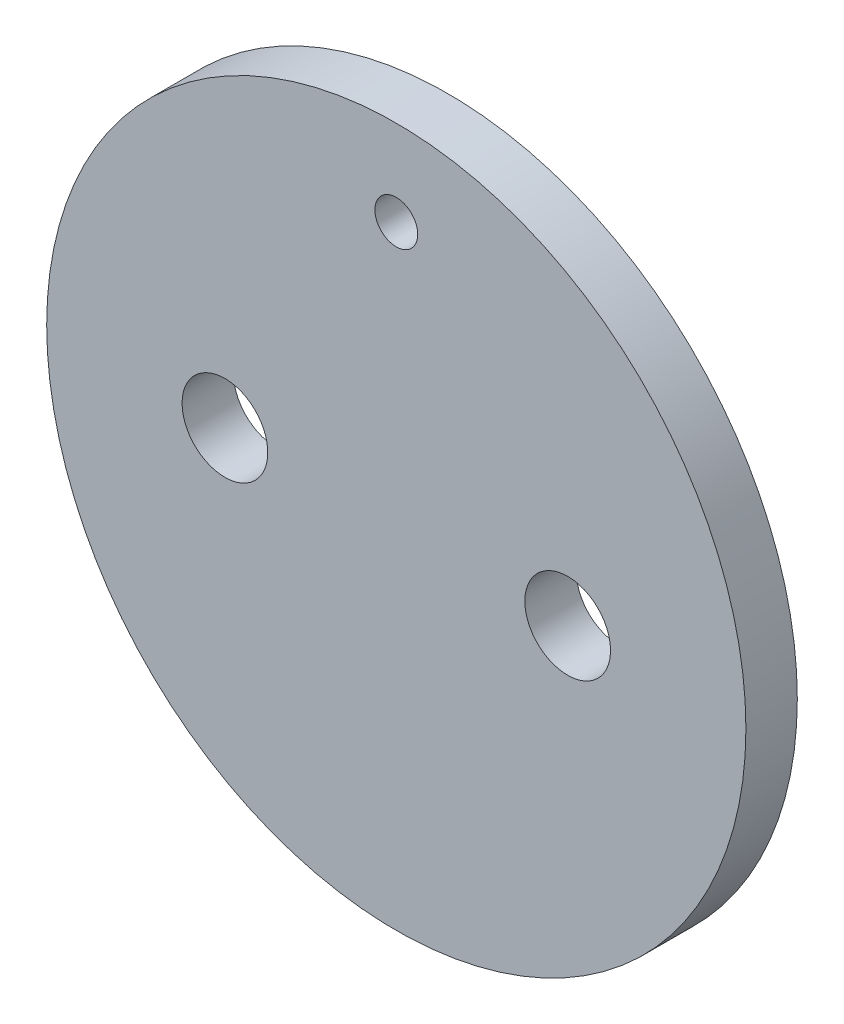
ISO-10303-21;
HEADER;
FILE_DESCRIPTION(('STEP AP214'),'2;1');
FILE_NAME('part.step','',(''),(''),'','','');
FILE_SCHEMA(('AUTOMOTIVE_DESIGN { 1 0 10303 214 1 1 1 1 }'));
ENDSEC;
DATA;
#1=APPLICATION_CONTEXT('core data for automotive mechanical design processes');
#2=APPLICATION_PROTOCOL_DEFINITION('international standard','automotive_design',2000,#1);
#3=PRODUCT_CONTEXT('',#1,'mechanical');
#4=PRODUCT('Part','Part','',(#3));
#5=PRODUCT_RELATED_PRODUCT_CATEGORY('part','',(#4));
#6=PRODUCT_DEFINITION_FORMATION('','',#4);
#7=PRODUCT_DEFINITION_CONTEXT('part definition',#1,'design');
#8=PRODUCT_DEFINITION('design','',#6,#7);
#9=PRODUCT_DEFINITION_SHAPE('','',#8);
#10=(LENGTH_UNIT() NAMED_UNIT(*) SI_UNIT(.MILLI.,.METRE.));
#11=(NAMED_UNIT(*) PLANE_ANGLE_UNIT() SI_UNIT($,.RADIAN.));
#12=(NAMED_UNIT(*) SI_UNIT($,.STERADIAN.) SOLID_ANGLE_UNIT());
#13=UNCERTAINTY_MEASURE_WITH_UNIT(LENGTH_MEASURE(1.E-05),#10,'distance_accuracy_value','');
#14=(GEOMETRIC_REPRESENTATION_CONTEXT(3) GLOBAL_UNCERTAINTY_ASSIGNED_CONTEXT((#13)) GLOBAL_UNIT_ASSIGNED_CONTEXT((#10,
#11,#12)) REPRESENTATION_CONTEXT('',''));
#15=CARTESIAN_POINT('',(0.,0.,0.));
#16=DIRECTION('',(0.,0.,1.));
#17=DIRECTION('',(1.,0.,0.));
#18=AXIS2_PLACEMENT_3D('',#15,#16,#17);
#19=CARTESIAN_POINT('',(0.,0.,3.81));
#20=DIRECTION('',(0.,0.,1.));
#21=DIRECTION('',(1.,0.,0.));
#22=AXIS2_PLACEMENT_3D('',#19,#20,#21);
#23=PLANE('',#22);
#24=CARTESIAN_POINT('',(12.7,0.,3.81));
#25=DIRECTION('',(0.,0.,1.));
#26=DIRECTION('',(1.,0.,0.));
#27=AXIS2_PLACEMENT_3D('',#24,#25,#26);
#28=CIRCLE('',#27,3.175);
#29=CARTESIAN_POINT('',(9.525,0.,3.81));
#30=VERTEX_POINT('',#29);
#31=EDGE_CURVE('E48',#30,#30,#28,.T.);
#32=ORIENTED_EDGE('',*,*,#31,.F.);
#33=EDGE_LOOP('',(#32));
#34=FACE_BOUND('',#33,.T.);
#35=CARTESIAN_POINT('',(0.,0.,3.81));
#36=DIRECTION('',(0.,0.,1.));
#37=DIRECTION('',(1.,0.,0.));
#38=AXIS2_PLACEMENT_3D('',#35,#36,#37);
#39=CIRCLE('',#38,25.908);
#40=CARTESIAN_POINT('',(-25.908,0.,3.81));
#41=VERTEX_POINT('',#40);
#42=EDGE_CURVE('E10',#41,#41,#39,.T.);
#43=ORIENTED_EDGE('',*,*,#42,.T.);
#44=EDGE_LOOP('',(#43));
#45=FACE_BOUND('',#44,.T.);
#46=CARTESIAN_POINT('',(0.,19.558,3.81));
#47=DIRECTION('',(0.,0.,1.));
#48=DIRECTION('',(1.,0.,0.));
#49=AXIS2_PLACEMENT_3D('',#46,#47,#48);
#50=CIRCLE('',#49,1.5875);
#51=CARTESIAN_POINT('',(-1.5875,19.558,3.81));
#52=VERTEX_POINT('',#51);
#53=EDGE_CURVE('E39',#52,#52,#50,.T.);
#54=ORIENTED_EDGE('',*,*,#53,.F.);
#55=EDGE_LOOP('',(#54));
#56=FACE_BOUND('',#55,.T.);
#57=CARTESIAN_POINT('',(-12.7,0.,3.81));
#58=DIRECTION('',(0.,0.,1.));
#59=DIRECTION('',(1.,0.,0.));
#60=AXIS2_PLACEMENT_3D('',#57,#58,#59);
#61=CIRCLE('',#60,3.175);
#62=CARTESIAN_POINT('',(-15.875,0.,3.81));
#63=VERTEX_POINT('',#62);
#64=EDGE_CURVE('E54',#63,#63,#61,.T.);
#65=ORIENTED_EDGE('',*,*,#64,.F.);
#66=EDGE_LOOP('',(#65));
#67=FACE_BOUND('',#66,.T.);
#68=ADVANCED_FACE('F28',(#34,#45,#56,#67),#23,.T.);
#69=CARTESIAN_POINT('',(0.,0.,0.));
#70=DIRECTION('',(0.,0.,1.));
#71=DIRECTION('',(1.,0.,0.));
#72=AXIS2_PLACEMENT_3D('',#69,#70,#71);
#73=PLANE('',#72);
#74=CARTESIAN_POINT('',(12.7,0.,0.));
#75=DIRECTION('',(0.,0.,1.));
#76=DIRECTION('',(1.,0.,0.));
#77=AXIS2_PLACEMENT_3D('',#74,#75,#76);
#78=CIRCLE('',#77,3.175);
#79=CARTESIAN_POINT('',(9.525,0.,0.));
#80=VERTEX_POINT('',#79);
#81=EDGE_CURVE('E51',#80,#80,#78,.T.);
#82=ORIENTED_EDGE('',*,*,#81,.T.);
#83=EDGE_LOOP('',(#82));
#84=FACE_BOUND('',#83,.T.);
#85=CARTESIAN_POINT('',(0.,0.,0.));
#86=DIRECTION('',(0.,0.,1.));
#87=DIRECTION('',(1.,0.,0.));
#88=AXIS2_PLACEMENT_3D('',#85,#86,#87);
#89=CIRCLE('',#88,25.908);
#90=CARTESIAN_POINT('',(-25.908,0.,0.));
#91=VERTEX_POINT('',#90);
#92=EDGE_CURVE('E35',#91,#91,#89,.T.);
#93=ORIENTED_EDGE('',*,*,#92,.F.);
#94=EDGE_LOOP('',(#93));
#95=FACE_BOUND('',#94,.T.);
#96=CARTESIAN_POINT('',(0.,19.558,0.));
#97=DIRECTION('',(0.,0.,1.));
#98=DIRECTION('',(1.,0.,0.));
#99=AXIS2_PLACEMENT_3D('',#96,#97,#98);
#100=CIRCLE('',#99,1.5875);
#101=CARTESIAN_POINT('',(-1.5875,19.558,0.));
#102=VERTEX_POINT('',#101);
#103=EDGE_CURVE('E43',#102,#102,#100,.T.);
#104=ORIENTED_EDGE('',*,*,#103,.T.);
#105=EDGE_LOOP('',(#104));
#106=FACE_BOUND('',#105,.T.);
#107=CARTESIAN_POINT('',(-12.7,0.,0.));
#108=DIRECTION('',(0.,0.,1.));
#109=DIRECTION('',(1.,0.,0.));
#110=AXIS2_PLACEMENT_3D('',#107,#108,#109);
#111=CIRCLE('',#110,3.175);
#112=CARTESIAN_POINT('',(-15.875,0.,0.));
#113=VERTEX_POINT('',#112);
#114=EDGE_CURVE('E57',#113,#113,#111,.T.);
#115=ORIENTED_EDGE('',*,*,#114,.T.);
#116=EDGE_LOOP('',(#115));
#117=FACE_BOUND('',#116,.T.);
#118=ADVANCED_FACE('F61',(#84,#95,#106,#117),#73,.F.);
#119=CARTESIAN_POINT('',(0.,0.,3.81));
#120=DIRECTION('',(0.,0.,-1.));
#121=DIRECTION('',(-1.,0.,0.));
#122=AXIS2_PLACEMENT_3D('',#119,#120,#121);
#123=CYLINDRICAL_SURFACE('',#122,25.908);
#124=CARTESIAN_POINT('',(-25.908,0.,3.81));
#125=CARTESIAN_POINT('',(-25.908,0.,3.7703125));
#126=CARTESIAN_POINT('',(-25.908,0.,3.730625));
#127=CARTESIAN_POINT('',(-25.908,0.,3.65125));
#128=CARTESIAN_POINT('',(-25.908,0.,3.6115625));
#129=CARTESIAN_POINT('',(-25.908,0.,3.5321875));
#130=CARTESIAN_POINT('',(-25.908,0.,3.4925));
#131=CARTESIAN_POINT('',(-25.908,0.,3.413125));
#132=CARTESIAN_POINT('',(-25.908,0.,3.3734375));
#133=CARTESIAN_POINT('',(-25.908,0.,3.2940625));
#134=CARTESIAN_POINT('',(-25.908,0.,3.254375));
#135=CARTESIAN_POINT('',(-25.908,0.,3.175));
#136=CARTESIAN_POINT('',(-25.908,0.,3.1353125));
#137=CARTESIAN_POINT('',(-25.908,0.,3.0559375));
#138=CARTESIAN_POINT('',(-25.908,0.,3.01625));
#139=CARTESIAN_POINT('',(-25.908,0.,2.936875));
#140=CARTESIAN_POINT('',(-25.908,0.,2.8971875));
#141=CARTESIAN_POINT('',(-25.908,0.,2.8178125));
#142=CARTESIAN_POINT('',(-25.908,0.,2.778125));
#143=CARTESIAN_POINT('',(-25.908,0.,2.69875));
#144=CARTESIAN_POINT('',(-25.908,0.,2.6590625));
#145=CARTESIAN_POINT('',(-25.908,0.,2.5796875));
#146=CARTESIAN_POINT('',(-25.908,0.,2.54));
#147=CARTESIAN_POINT('',(-25.908,0.,2.460625));
#148=CARTESIAN_POINT('',(-25.908,0.,2.4209375));
#149=CARTESIAN_POINT('',(-25.908,0.,2.3415625));
#150=CARTESIAN_POINT('',(-25.908,0.,2.301875));
#151=CARTESIAN_POINT('',(-25.908,0.,2.2225));
#152=CARTESIAN_POINT('',(-25.908,0.,2.1828125));
#153=CARTESIAN_POINT('',(-25.908,0.,2.1034375));
#154=CARTESIAN_POINT('',(-25.908,0.,2.06375));
#155=CARTESIAN_POINT('',(-25.908,0.,1.984375));
#156=CARTESIAN_POINT('',(-25.908,0.,1.9446875));
#157=CARTESIAN_POINT('',(-25.908,0.,1.8653125));
#158=CARTESIAN_POINT('',(-25.908,0.,1.825625));
#159=CARTESIAN_POINT('',(-25.908,0.,1.74625));
#160=CARTESIAN_POINT('',(-25.908,0.,1.7065625));
#161=CARTESIAN_POINT('',(-25.908,0.,1.6271875));
#162=CARTESIAN_POINT('',(-25.908,0.,1.5875));
#163=CARTESIAN_POINT('',(-25.908,0.,1.508125));
#164=CARTESIAN_POINT('',(-25.908,0.,1.4684375));
#165=CARTESIAN_POINT('',(-25.908,0.,1.3890625));
#166=CARTESIAN_POINT('',(-25.908,0.,1.349375));
#167=CARTESIAN_POINT('',(-25.908,0.,1.27));
#168=CARTESIAN_POINT('',(-25.908,0.,1.2303125));
#169=CARTESIAN_POINT('',(-25.908,0.,1.1509375));
#170=CARTESIAN_POINT('',(-25.908,0.,1.11125));
#171=CARTESIAN_POINT('',(-25.908,0.,1.031875));
#172=CARTESIAN_POINT('',(-25.908,0.,0.9921875));
#173=CARTESIAN_POINT('',(-25.908,0.,0.9128125));
#174=CARTESIAN_POINT('',(-25.908,0.,0.873125));
#175=CARTESIAN_POINT('',(-25.908,0.,0.79375));
#176=CARTESIAN_POINT('',(-25.908,0.,0.7540625));
#177=CARTESIAN_POINT('',(-25.908,0.,0.6746875));
#178=CARTESIAN_POINT('',(-25.908,0.,0.635));
#179=CARTESIAN_POINT('',(-25.908,0.,0.555625));
#180=CARTESIAN_POINT('',(-25.908,0.,0.5159375));
#181=CARTESIAN_POINT('',(-25.908,0.,0.4365625));
#182=CARTESIAN_POINT('',(-25.908,0.,0.396875));
#183=CARTESIAN_POINT('',(-25.908,0.,0.3175));
#184=CARTESIAN_POINT('',(-25.908,0.,0.2778125));
#185=CARTESIAN_POINT('',(-25.908,0.,0.1984375));
#186=CARTESIAN_POINT('',(-25.908,0.,0.15875));
#187=CARTESIAN_POINT('',(-25.908,0.,0.0793749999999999));
#188=CARTESIAN_POINT('',(-25.908,0.,0.0396874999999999));
#189=CARTESIAN_POINT('',(-25.908,0.,0.));
#190=B_SPLINE_CURVE_WITH_KNOTS('',3,(#124,#125,#126,#127,#128,#129,#130,#131,#132,#133,#134,
#135,#136,#137,#138,#139,#140,#141,#142,#143,#144,#145,#146,#147,#148,#149,#150,#151,#152,#153,
#154,#155,#156,#157,#158,#159,#160,#161,#162,#163,#164,#165,#166,#167,#168,#169,#170,#171,#172,
#173,#174,#175,#176,#177,#178,#179,#180,#181,#182,#183,#184,#185,#186,#187,#188,#189),
.UNSPECIFIED.,.F.,.F.,(4,2,2,2,2,2,2,2,2,2,2,2,2,2,2,2,2,2,2,2,2,2,2,2,2,2,2,2,2,2,2,2,4),(0.,
0.1190625,0.238125,0.3571875,0.47625,0.5953125,0.714375,0.8334375,0.9525,1.0715625,1.190625,
1.3096875,1.42875,1.5478125,1.666875,1.7859375,1.905,2.0240625,2.143125,2.2621875,2.38125,
2.5003125,2.619375,2.7384375,2.8575,2.9765625,3.095625,3.2146875,3.33375,3.4528125,3.571875,
3.6909375,3.81),.UNSPECIFIED.);
#191=EDGE_CURVE('BSEAM30',#41,#91,#190,.T.);
#192=ORIENTED_EDGE('',*,*,#42,.F.);
#193=ORIENTED_EDGE('',*,*,#92,.T.);
#194=ORIENTED_EDGE('',*,*,#191,.T.);
#195=ORIENTED_EDGE('',*,*,#191,.F.);
#196=EDGE_LOOP('',(#192,#194,#193,#195));
#197=FACE_BOUND('',#196,.T.);
#198=ADVANCED_FACE('F30',(#197),#123,.T.);
#199=CARTESIAN_POINT('',(0.,19.558,3.81));
#200=DIRECTION('',(0.,0.,-1.));
#201=DIRECTION('',(-1.,0.,0.));
#202=AXIS2_PLACEMENT_3D('',#199,#200,#201);
#203=CYLINDRICAL_SURFACE('',#202,1.5875);
#204=CARTESIAN_POINT('',(-1.5875,19.558,3.81));
#205=CARTESIAN_POINT('',(-1.5875,19.558,3.7703125));
#206=CARTESIAN_POINT('',(-1.5875,19.558,3.730625));
#207=CARTESIAN_POINT('',(-1.5875,19.558,3.65125));
#208=CARTESIAN_POINT('',(-1.5875,19.558,3.6115625));
#209=CARTESIAN_POINT('',(-1.5875,19.558,3.5321875));
#210=CARTESIAN_POINT('',(-1.5875,19.558,3.4925));
#211=CARTESIAN_POINT('',(-1.5875,19.558,3.413125));
#212=CARTESIAN_POINT('',(-1.5875,19.558,3.3734375));
#213=CARTESIAN_POINT('',(-1.5875,19.558,3.2940625));
#214=CARTESIAN_POINT('',(-1.5875,19.558,3.254375));
#215=CARTESIAN_POINT('',(-1.5875,19.558,3.175));
#216=CARTESIAN_POINT('',(-1.5875,19.558,3.1353125));
#217=CARTESIAN_POINT('',(-1.5875,19.558,3.0559375));
#218=CARTESIAN_POINT('',(-1.5875,19.558,3.01625));
#219=CARTESIAN_POINT('',(-1.5875,19.558,2.936875));
#220=CARTESIAN_POINT('',(-1.5875,19.558,2.8971875));
#221=CARTESIAN_POINT('',(-1.5875,19.558,2.8178125));
#222=CARTESIAN_POINT('',(-1.5875,19.558,2.778125));
#223=CARTESIAN_POINT('',(-1.5875,19.558,2.69875));
#224=CARTESIAN_POINT('',(-1.5875,19.558,2.6590625));
#225=CARTESIAN_POINT('',(-1.5875,19.558,2.5796875));
#226=CARTESIAN_POINT('',(-1.5875,19.558,2.54));
#227=CARTESIAN_POINT('',(-1.5875,19.558,2.460625));
#228=CARTESIAN_POINT('',(-1.5875,19.558,2.4209375));
#229=CARTESIAN_POINT('',(-1.5875,19.558,2.3415625));
#230=CARTESIAN_POINT('',(-1.5875,19.558,2.301875));
#231=CARTESIAN_POINT('',(-1.5875,19.558,2.2225));
#232=CARTESIAN_POINT('',(-1.5875,19.558,2.1828125));
#233=CARTESIAN_POINT('',(-1.5875,19.558,2.1034375));
#234=CARTESIAN_POINT('',(-1.5875,19.558,2.06375));
#235=CARTESIAN_POINT('',(-1.5875,19.558,1.984375));
#236=CARTESIAN_POINT('',(-1.5875,19.558,1.9446875));
#237=CARTESIAN_POINT('',(-1.5875,19.558,1.8653125));
#238=CARTESIAN_POINT('',(-1.5875,19.558,1.825625));
#239=CARTESIAN_POINT('',(-1.5875,19.558,1.74625));
#240=CARTESIAN_POINT('',(-1.5875,19.558,1.7065625));
#241=CARTESIAN_POINT('',(-1.5875,19.558,1.6271875));
#242=CARTESIAN_POINT('',(-1.5875,19.558,1.5875));
#243=CARTESIAN_POINT('',(-1.5875,19.558,1.508125));
#244=CARTESIAN_POINT('',(-1.5875,19.558,1.4684375));
#245=CARTESIAN_POINT('',(-1.5875,19.558,1.3890625));
#246=CARTESIAN_POINT('',(-1.5875,19.558,1.349375));
#247=CARTESIAN_POINT('',(-1.5875,19.558,1.27));
#248=CARTESIAN_POINT('',(-1.5875,19.558,1.2303125));
#249=CARTESIAN_POINT('',(-1.5875,19.558,1.1509375));
#250=CARTESIAN_POINT('',(-1.5875,19.558,1.11125));
#251=CARTESIAN_POINT('',(-1.5875,19.558,1.031875));
#252=CARTESIAN_POINT('',(-1.5875,19.558,0.9921875));
#253=CARTESIAN_POINT('',(-1.5875,19.558,0.9128125));
#254=CARTESIAN_POINT('',(-1.5875,19.558,0.873125));
#255=CARTESIAN_POINT('',(-1.5875,19.558,0.79375));
#256=CARTESIAN_POINT('',(-1.5875,19.558,0.7540625));
#257=CARTESIAN_POINT('',(-1.5875,19.558,0.6746875));
#258=CARTESIAN_POINT('',(-1.5875,19.558,0.635));
#259=CARTESIAN_POINT('',(-1.5875,19.558,0.555625));
#260=CARTESIAN_POINT('',(-1.5875,19.558,0.5159375));
#261=CARTESIAN_POINT('',(-1.5875,19.558,0.4365625));
#262=CARTESIAN_POINT('',(-1.5875,19.558,0.396875));
#263=CARTESIAN_POINT('',(-1.5875,19.558,0.3175));
#264=CARTESIAN_POINT('',(-1.5875,19.558,0.2778125));
#265=CARTESIAN_POINT('',(-1.5875,19.558,0.1984375));
#266=CARTESIAN_POINT('',(-1.5875,19.558,0.15875));
#267=CARTESIAN_POINT('',(-1.5875,19.558,0.0793749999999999));
#268=CARTESIAN_POINT('',(-1.5875,19.558,0.0396874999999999));
#269=CARTESIAN_POINT('',(-1.5875,19.558,0.));
#270=B_SPLINE_CURVE_WITH_KNOTS('',3,(#204,#205,#206,#207,#208,#209,#210,#211,#212,#213,#214,
#215,#216,#217,#218,#219,#220,#221,#222,#223,#224,#225,#226,#227,#228,#229,#230,#231,#232,#233,
#234,#235,#236,#237,#238,#239,#240,#241,#242,#243,#244,#245,#246,#247,#248,#249,#250,#251,#252,
#253,#254,#255,#256,#257,#258,#259,#260,#261,#262,#263,#264,#265,#266,#267,#268,#269),
.UNSPECIFIED.,.F.,.F.,(4,2,2,2,2,2,2,2,2,2,2,2,2,2,2,2,2,2,2,2,2,2,2,2,2,2,2,2,2,2,2,2,4),(0.,
0.1190625,0.238125,0.3571875,0.47625,0.5953125,0.714375,0.8334375,0.9525,1.0715625,1.190625,
1.3096875,1.42875,1.5478125,1.666875,1.7859375,1.905,2.0240625,2.143125,2.2621875,2.38125,
2.5003125,2.619375,2.7384375,2.8575,2.9765625,3.095625,3.2146875,3.33375,3.4528125,3.571875,
3.6909375,3.81),.UNSPECIFIED.);
#271=EDGE_CURVE('BSEAM71',#52,#102,#270,.T.);
#272=ORIENTED_EDGE('',*,*,#53,.T.);
#273=ORIENTED_EDGE('',*,*,#103,.F.);
#274=ORIENTED_EDGE('',*,*,#271,.T.);
#275=ORIENTED_EDGE('',*,*,#271,.F.);
#276=EDGE_LOOP('',(#272,#274,#273,#275));
#277=FACE_BOUND('',#276,.T.);
#278=ADVANCED_FACE('F71',(#277),#203,.F.);
#279=CARTESIAN_POINT('',(12.7,0.,3.81));
#280=DIRECTION('',(0.,0.,-1.));
#281=DIRECTION('',(-1.,0.,0.));
#282=AXIS2_PLACEMENT_3D('',#279,#280,#281);
#283=CYLINDRICAL_SURFACE('',#282,3.175);
#284=CARTESIAN_POINT('',(9.525,0.,3.81));
#285=CARTESIAN_POINT('',(9.525,0.,3.7703125));
#286=CARTESIAN_POINT('',(9.525,0.,3.730625));
#287=CARTESIAN_POINT('',(9.525,0.,3.65125));
#288=CARTESIAN_POINT('',(9.525,0.,3.6115625));
#289=CARTESIAN_POINT('',(9.525,0.,3.5321875));
#290=CARTESIAN_POINT('',(9.525,0.,3.4925));
#291=CARTESIAN_POINT('',(9.525,0.,3.413125));
#292=CARTESIAN_POINT('',(9.525,0.,3.3734375));
#293=CARTESIAN_POINT('',(9.525,0.,3.2940625));
#294=CARTESIAN_POINT('',(9.525,0.,3.254375));
#295=CARTESIAN_POINT('',(9.525,0.,3.175));
#296=CARTESIAN_POINT('',(9.525,0.,3.1353125));
#297=CARTESIAN_POINT('',(9.525,0.,3.0559375));
#298=CARTESIAN_POINT('',(9.525,0.,3.01625));
#299=CARTESIAN_POINT('',(9.525,0.,2.936875));
#300=CARTESIAN_POINT('',(9.525,0.,2.8971875));
#301=CARTESIAN_POINT('',(9.525,0.,2.8178125));
#302=CARTESIAN_POINT('',(9.525,0.,2.778125));
#303=CARTESIAN_POINT('',(9.525,0.,2.69875));
#304=CARTESIAN_POINT('',(9.525,0.,2.6590625));
#305=CARTESIAN_POINT('',(9.525,0.,2.5796875));
#306=CARTESIAN_POINT('',(9.525,0.,2.54));
#307=CARTESIAN_POINT('',(9.525,0.,2.460625));
#308=CARTESIAN_POINT('',(9.525,0.,2.4209375));
#309=CARTESIAN_POINT('',(9.525,0.,2.3415625));
#310=CARTESIAN_POINT('',(9.525,0.,2.301875));
#311=CARTESIAN_POINT('',(9.525,0.,2.2225));
#312=CARTESIAN_POINT('',(9.525,0.,2.1828125));
#313=CARTESIAN_POINT('',(9.525,0.,2.1034375));
#314=CARTESIAN_POINT('',(9.525,0.,2.06375));
#315=CARTESIAN_POINT('',(9.525,0.,1.984375));
#316=CARTESIAN_POINT('',(9.525,0.,1.9446875));
#317=CARTESIAN_POINT('',(9.525,0.,1.8653125));
#318=CARTESIAN_POINT('',(9.525,0.,1.825625));
#319=CARTESIAN_POINT('',(9.525,0.,1.74625));
#320=CARTESIAN_POINT('',(9.525,0.,1.7065625));
#321=CARTESIAN_POINT('',(9.525,0.,1.6271875));
#322=CARTESIAN_POINT('',(9.525,0.,1.5875));
#323=CARTESIAN_POINT('',(9.525,0.,1.508125));
#324=CARTESIAN_POINT('',(9.525,0.,1.4684375));
#325=CARTESIAN_POINT('',(9.525,0.,1.3890625));
#326=CARTESIAN_POINT('',(9.525,0.,1.349375));
#327=CARTESIAN_POINT('',(9.525,0.,1.27));
#328=CARTESIAN_POINT('',(9.525,0.,1.2303125));
#329=CARTESIAN_POINT('',(9.525,0.,1.1509375));
#330=CARTESIAN_POINT('',(9.525,0.,1.11125));
#331=CARTESIAN_POINT('',(9.525,0.,1.031875));
#332=CARTESIAN_POINT('',(9.525,0.,0.9921875));
#333=CARTESIAN_POINT('',(9.525,0.,0.9128125));
#334=CARTESIAN_POINT('',(9.525,0.,0.873125));
#335=CARTESIAN_POINT('',(9.525,0.,0.79375));
#336=CARTESIAN_POINT('',(9.525,0.,0.7540625));
#337=CARTESIAN_POINT('',(9.525,0.,0.6746875));
#338=CARTESIAN_POINT('',(9.525,0.,0.635));
#339=CARTESIAN_POINT('',(9.525,0.,0.555625));
#340=CARTESIAN_POINT('',(9.525,0.,0.5159375));
#341=CARTESIAN_POINT('',(9.525,0.,0.4365625));
#342=CARTESIAN_POINT('',(9.525,0.,0.396875));
#343=CARTESIAN_POINT('',(9.525,0.,0.3175));
#344=CARTESIAN_POINT('',(9.525,0.,0.2778125));
#345=CARTESIAN_POINT('',(9.525,0.,0.1984375));
#346=CARTESIAN_POINT('',(9.525,0.,0.15875));
#347=CARTESIAN_POINT('',(9.525,0.,0.0793749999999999));
#348=CARTESIAN_POINT('',(9.525,0.,0.0396874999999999));
#349=CARTESIAN_POINT('',(9.525,0.,0.));
#350=B_SPLINE_CURVE_WITH_KNOTS('',3,(#284,#285,#286,#287,#288,#289,#290,#291,#292,#293,#294,
#295,#296,#297,#298,#299,#300,#301,#302,#303,#304,#305,#306,#307,#308,#309,#310,#311,#312,#313,
#314,#315,#316,#317,#318,#319,#320,#321,#322,#323,#324,#325,#326,#327,#328,#329,#330,#331,#332,
#333,#334,#335,#336,#337,#338,#339,#340,#341,#342,#343,#344,#345,#346,#347,#348,#349),
.UNSPECIFIED.,.F.,.F.,(4,2,2,2,2,2,2,2,2,2,2,2,2,2,2,2,2,2,2,2,2,2,2,2,2,2,2,2,2,2,2,2,4),(0.,
0.1190625,0.238125,0.3571875,0.47625,0.595312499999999,0.714375,0.833437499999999,
0.952499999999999,1.0715625,1.190625,1.3096875,1.42875,1.5478125,1.666875,1.7859375,1.905,
2.0240625,2.143125,2.2621875,2.38125,2.5003125,2.619375,2.7384375,2.8575,2.9765625,3.095625,
3.2146875,3.33375,3.4528125,3.571875,3.6909375,3.81),.UNSPECIFIED.);
#351=EDGE_CURVE('BSEAM65',#30,#80,#350,.T.);
#352=ORIENTED_EDGE('',*,*,#31,.T.);
#353=ORIENTED_EDGE('',*,*,#81,.F.);
#354=ORIENTED_EDGE('',*,*,#351,.T.);
#355=ORIENTED_EDGE('',*,*,#351,.F.);
#356=EDGE_LOOP('',(#352,#354,#353,#355));
#357=FACE_BOUND('',#356,.T.);
#358=ADVANCED_FACE('F65',(#357),#283,.F.);
#359=CARTESIAN_POINT('',(-12.7,0.,3.81));
#360=DIRECTION('',(0.,0.,-1.));
#361=DIRECTION('',(-1.,0.,0.));
#362=AXIS2_PLACEMENT_3D('',#359,#360,#361);
#363=CYLINDRICAL_SURFACE('',#362,3.175);
#364=CARTESIAN_POINT('',(-15.875,0.,3.81));
#365=CARTESIAN_POINT('',(-15.875,0.,3.7703125));
#366=CARTESIAN_POINT('',(-15.875,0.,3.730625));
#367=CARTESIAN_POINT('',(-15.875,0.,3.65125));
#368=CARTESIAN_POINT('',(-15.875,0.,3.6115625));
#369=CARTESIAN_POINT('',(-15.875,0.,3.5321875));
#370=CARTESIAN_POINT('',(-15.875,0.,3.4925));
#371=CARTESIAN_POINT('',(-15.875,0.,3.413125));
#372=CARTESIAN_POINT('',(-15.875,0.,3.3734375));
#373=CARTESIAN_POINT('',(-15.875,0.,3.2940625));
#374=CARTESIAN_POINT('',(-15.875,0.,3.254375));
#375=CARTESIAN_POINT('',(-15.875,0.,3.175));
#376=CARTESIAN_POINT('',(-15.875,0.,3.1353125));
#377=CARTESIAN_POINT('',(-15.875,0.,3.0559375));
#378=CARTESIAN_POINT('',(-15.875,0.,3.01625));
#379=CARTESIAN_POINT('',(-15.875,0.,2.936875));
#380=CARTESIAN_POINT('',(-15.875,0.,2.8971875));
#381=CARTESIAN_POINT('',(-15.875,0.,2.8178125));
#382=CARTESIAN_POINT('',(-15.875,0.,2.778125));
#383=CARTESIAN_POINT('',(-15.875,0.,2.69875));
#384=CARTESIAN_POINT('',(-15.875,0.,2.6590625));
#385=CARTESIAN_POINT('',(-15.875,0.,2.5796875));
#386=CARTESIAN_POINT('',(-15.875,0.,2.54));
#387=CARTESIAN_POINT('',(-15.875,0.,2.460625));
#388=CARTESIAN_POINT('',(-15.875,0.,2.4209375));
#389=CARTESIAN_POINT('',(-15.875,0.,2.3415625));
#390=CARTESIAN_POINT('',(-15.875,0.,2.301875));
#391=CARTESIAN_POINT('',(-15.875,0.,2.2225));
#392=CARTESIAN_POINT('',(-15.875,0.,2.1828125));
#393=CARTESIAN_POINT('',(-15.875,0.,2.1034375));
#394=CARTESIAN_POINT('',(-15.875,0.,2.06375));
#395=CARTESIAN_POINT('',(-15.875,0.,1.984375));
#396=CARTESIAN_POINT('',(-15.875,0.,1.9446875));
#397=CARTESIAN_POINT('',(-15.875,0.,1.8653125));
#398=CARTESIAN_POINT('',(-15.875,0.,1.825625));
#399=CARTESIAN_POINT('',(-15.875,0.,1.74625));
#400=CARTESIAN_POINT('',(-15.875,0.,1.7065625));
#401=CARTESIAN_POINT('',(-15.875,0.,1.6271875));
#402=CARTESIAN_POINT('',(-15.875,0.,1.5875));
#403=CARTESIAN_POINT('',(-15.875,0.,1.508125));
#404=CARTESIAN_POINT('',(-15.875,0.,1.4684375));
#405=CARTESIAN_POINT('',(-15.875,0.,1.3890625));
#406=CARTESIAN_POINT('',(-15.875,0.,1.349375));
#407=CARTESIAN_POINT('',(-15.875,0.,1.27));
#408=CARTESIAN_POINT('',(-15.875,0.,1.2303125));
#409=CARTESIAN_POINT('',(-15.875,0.,1.1509375));
#410=CARTESIAN_POINT('',(-15.875,0.,1.11125));
#411=CARTESIAN_POINT('',(-15.875,0.,1.031875));
#412=CARTESIAN_POINT('',(-15.875,0.,0.9921875));
#413=CARTESIAN_POINT('',(-15.875,0.,0.9128125));
#414=CARTESIAN_POINT('',(-15.875,0.,0.873125));
#415=CARTESIAN_POINT('',(-15.875,0.,0.79375));
#416=CARTESIAN_POINT('',(-15.875,0.,0.7540625));
#417=CARTESIAN_POINT('',(-15.875,0.,0.6746875));
#418=CARTESIAN_POINT('',(-15.875,0.,0.635));
#419=CARTESIAN_POINT('',(-15.875,0.,0.555625));
#420=CARTESIAN_POINT('',(-15.875,0.,0.5159375));
#421=CARTESIAN_POINT('',(-15.875,0.,0.4365625));
#422=CARTESIAN_POINT('',(-15.875,0.,0.396875));
#423=CARTESIAN_POINT('',(-15.875,0.,0.3175));
#424=CARTESIAN_POINT('',(-15.875,0.,0.2778125));
#425=CARTESIAN_POINT('',(-15.875,0.,0.1984375));
#426=CARTESIAN_POINT('',(-15.875,0.,0.15875));
#427=CARTESIAN_POINT('',(-15.875,0.,0.0793749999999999));
#428=CARTESIAN_POINT('',(-15.875,0.,0.0396874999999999));
#429=CARTESIAN_POINT('',(-15.875,0.,0.));
#430=B_SPLINE_CURVE_WITH_KNOTS('',3,(#364,#365,#366,#367,#368,#369,#370,#371,#372,#373,#374,
#375,#376,#377,#378,#379,#380,#381,#382,#383,#384,#385,#386,#387,#388,#389,#390,#391,#392,#393,
#394,#395,#396,#397,#398,#399,#400,#401,#402,#403,#404,#405,#406,#407,#408,#409,#410,#411,#412,
#413,#414,#415,#416,#417,#418,#419,#420,#421,#422,#423,#424,#425,#426,#427,#428,#429),
.UNSPECIFIED.,.F.,.F.,(4,2,2,2,2,2,2,2,2,2,2,2,2,2,2,2,2,2,2,2,2,2,2,2,2,2,2,2,2,2,2,2,4),(0.,
0.1190625,0.238125,0.3571875,0.47625,0.595312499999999,0.714375,0.833437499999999,
0.952499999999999,1.0715625,1.190625,1.3096875,1.42875,1.5478125,1.666875,1.7859375,1.905,
2.0240625,2.143125,2.2621875,2.38125,2.5003125,2.619375,2.7384375,2.8575,2.9765625,3.095625,
3.2146875,3.33375,3.4528125,3.571875,3.6909375,3.81),.UNSPECIFIED.);
#431=EDGE_CURVE('BSEAM63',#63,#113,#430,.T.);
#432=ORIENTED_EDGE('',*,*,#64,.T.);
#433=ORIENTED_EDGE('',*,*,#114,.F.);
#434=ORIENTED_EDGE('',*,*,#431,.T.);
#435=ORIENTED_EDGE('',*,*,#431,.F.);
#436=EDGE_LOOP('',(#432,#434,#433,#435));
#437=FACE_BOUND('',#436,.T.);
#438=ADVANCED_FACE('F63',(#437),#363,.F.);
#439=CLOSED_SHELL('',(#68,#118,#198,#278,#358,#438));
#440=MANIFOLD_SOLID_BREP('B2',#439);
#441=ADVANCED_BREP_SHAPE_REPRESENTATION('',(#18,#440),#14);
#442=SHAPE_DEFINITION_REPRESENTATION(#9,#441);
ENDSEC;
END-ISO-10303-21;
